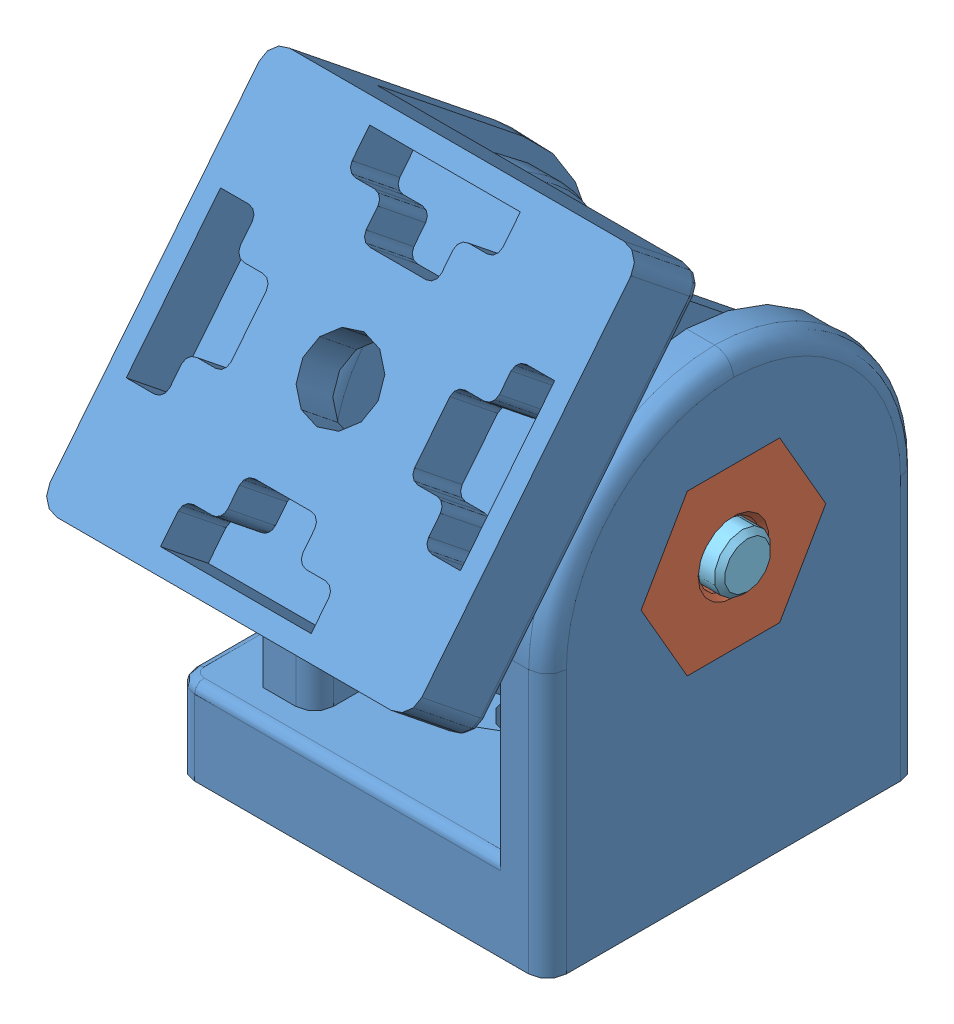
SolidWorks assembly 2024.SLDASM, configuration По умолчанию (file format 11000). Lengths in mm.
Overall size (41 63.37 62.25).
6 component instances, 5 part files, 14 mates.
Components (placement in the parent):
- 2024-1-1: 2024-1.SLDPRT [По умолчанию] at (-19.75 -9 -19.75) x (1 0 0) z (0 1 0) size (39.61 39.5 48.11)
- 2024-1-2: 2024-1.SLDPRT [По умолчанию] at (-18.75 38.9721 3.2518) x (-1 0 0) z (0 -0.626143 -0.779708) size (39.61 39.5 48.11)
- 2024-2-1: 2024-2.SLDPRT [По умолчанию] at (0 20.5005 -19.75) x (0 0.866025 -0.5) z (0 0.5 0.866025) size (19.63 7 17)
- 2024-3-1: 2024-3.SLDPRT [По умолчанию] at (-38.5 20.5005 -19.75) x (0 -0.93211 -0.362176) z (0 -0.362176 0.93211) size (19.63 7 17)
- 2024-4-1: 2024-4.SLDPRT [По умолчанию] at (-19.25 20.5005 -19.75) x (0 -1 0) z (0 0 1) size (16 19.5 16)
- 2024-5-1: 2024-5.SLDPRT [По умолчанию] at (-38.5 20.5005 -19.75) size (40 11.57 11.57)
Mates (geometry in assembly coordinates):
- Совпадение1: coincident: plane of 2024-1-1 through (-39.5 0 0) normal (0 0 1); plane of assembly through (0 0 0) normal (0 0 1)
- Совпадение2: coincident: plane of 2024-1-1 through (0 0 -39.5) normal (1 0 0); plane of assembly through (0 0 0) normal (1 0 0)
- Совпадение3: coincident: plane of 2024-1-1 through (-19.75 0 -19.75) normal (0 1 0); plane of assembly through (0 0 0) normal (0 1 0)
- Совпадение4: coincident: plane of 2024-1-1 through (-33.5 39 -36.25) normal (-1 0 0); plane of 2024-1-2 through (-33.5 24.3164 -46.5405) normal (1 0 0)
- Концентричный1: concentric: cylinder of 2024-1-1 through (-51.8848 20.5005 -19.75) axis (1 0 0) radius 6.5; cylinder of 2024-1-2 through (13.3848 20.5005 -19.75) axis (-1 0 0) radius 6.5
- Совпадение5: coincident: plane of 2024-1-1 through (-2 -9 -19.75) normal (1 0 0); plane of 2024-2-1 through (-2 20.5005 -19.75) normal (-1 0 0)
- Совпадение6: coincident: plane of 2024-1-1 through (-2 29.0005 -24.6575) normal (0 -1 0); plane of 2024-2-1 through (-2 29.0005 -14.8425) normal (0 1 0)
- Совпадение7: coincident: plane of 2024-1-1 through (-2 29.0005 -14.8425) normal (0 -0.5 -0.866025); plane of 2024-2-1 through (-2 20.5005 -9.935) normal (0 0.5 0.866025)
- Совпадение8: coincident: plane of 2024-1-2 through (-36.5 38.9721 3.2518) normal (-1 0 0); plane of 2024-3-1 through (-36.5 20.5005 -19.75) normal (1 0 0)
- Совпадение9: coincident: plane of 2024-1-2 through (-36.5 29.6491 -16.1953) normal (0 -0.988319 0.152401); plane of 2024-3-1 through (-36.5 28.1533 -25.8956) normal (0 0.988319 -0.152401)
- Совпадение10: coincident: plane of 2024-1-2 through (-36.5 21.9963 -10.0497) normal (0 -0.626143 -0.779708); plane of 2024-3-1 through (-36.5 29.6491 -16.1953) normal (0 0.626143 0.779708)
- Совпадение13: coincident: plane of 2024-1-1 through (-29 22.5 -19.75) normal (1 0 0); plane of 2024-4-1 through (-29 20.5005 -27.75) normal (-1 0 0)
- Концентричный2: concentric: cylinder of 2024-3-1 through (-38.5 20.5005 -19.75) axis (1 0 0) radius 4.25; cylinder of 2024-5-1 through (1.5 20.5005 -19.75) axis (1 0 0) radius 3
- Совпадение14: coincident: plane of 2024-1-2 through (-38.5 48.736 -16.1319) normal (-1 0 0); plane of 2024-5-1 through (-38.5 20.5005 -19.75) normal (-1 0 0)
